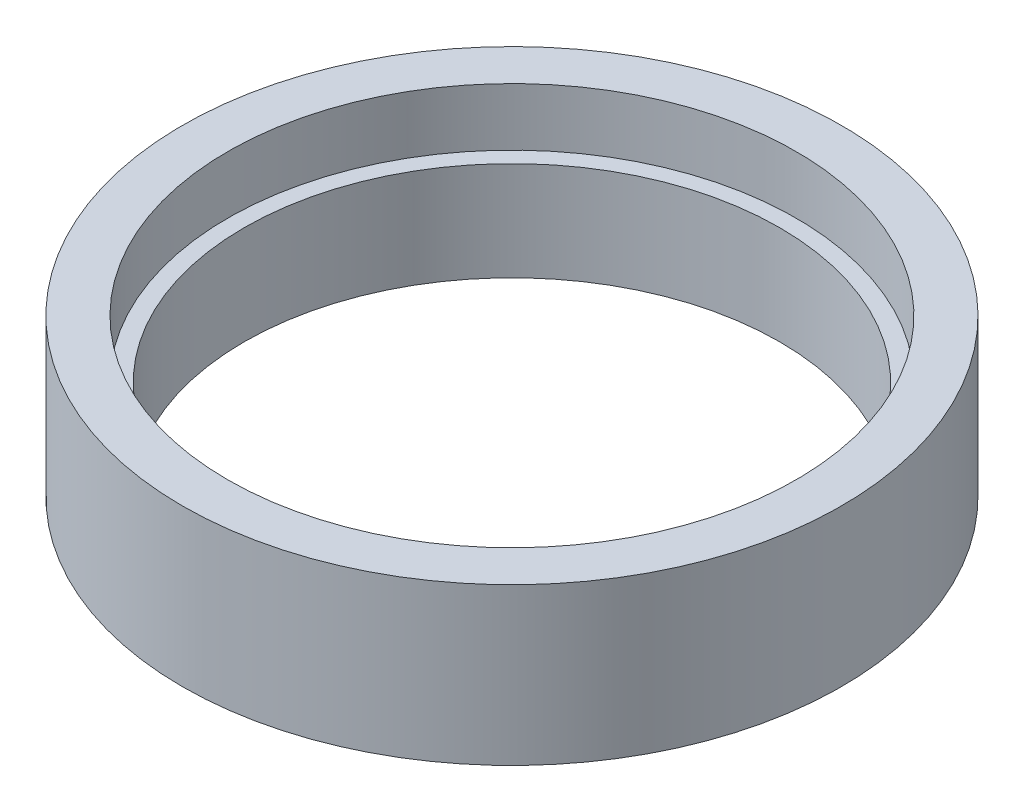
from build123d import *

# Parameters (mm, degrees)
CROQUIS1_R              = 40
SALIENTE_EXTRUIR1_DEPTH = 19
CROQUIS2_R              = 32.5
CORTAR_EXTRUIR1_DEPTH   = 19
CROQUIS3_R              = 34.5
CORTAR_EXTRUIR2_DEPTH   = 7


with BuildPart() as part:
    # Croquis1 → Saliente-Extruir1 (new body)
    with BuildSketch(Plane(origin=(0, 0, 0), x_dir=(1, 0, 0), z_dir=(0, 1, 0))):
        with Locations(Location((0, 0, 0), (0, 0, 270))):
            Circle(CROQUIS1_R)
    extrude(amount=SALIENTE_EXTRUIR1_DEPTH)

    # Croquis2 → Cortar-Extruir1 (cut)
    with BuildSketch(Plane(origin=(0, 19, 0), x_dir=(1, 0, 0), z_dir=(0, 1, 0))):
        with Locations(Location((0, 0, 0), (0, 0, 270))):
            Circle(CROQUIS2_R)
    extrude(amount=-CORTAR_EXTRUIR1_DEPTH, mode=Mode.SUBTRACT)

    # Croquis3 → Cortar-Extruir2 (cut)
    with BuildSketch(Plane(origin=(0, 19, 0), x_dir=(1, 0, 0), z_dir=(0, 1, 0))):
        with Locations(Location((0, 0, 0), (0, 0, 270))):
            Circle(CROQUIS3_R)
    extrude(amount=-CORTAR_EXTRUIR2_DEPTH, mode=Mode.SUBTRACT)


solid = part.part
